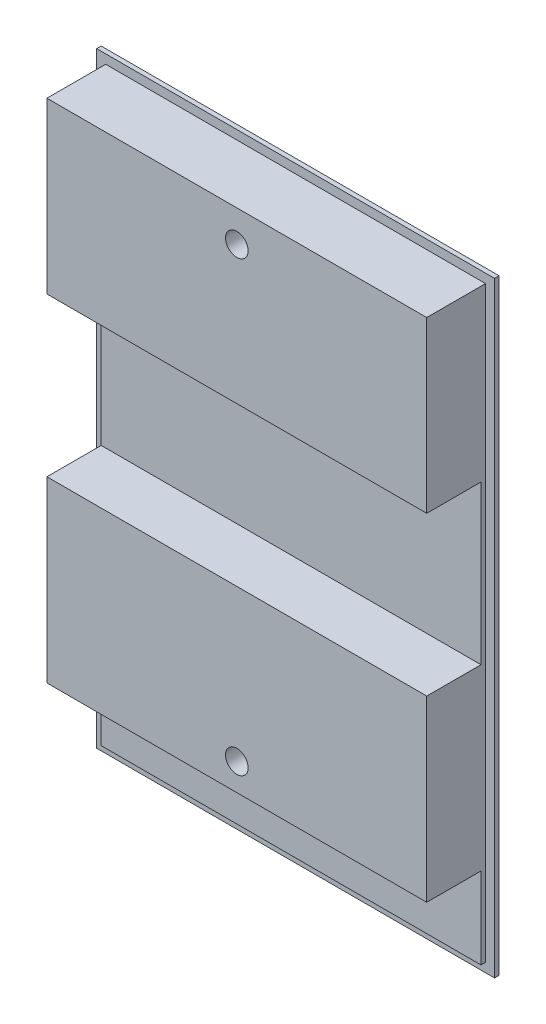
from build123d import *

# Parameters (mm, degrees)
SKIZZE1_W                       = 84
SKIZZE1_H                       = 130
AUFSATZ_LINEAR_AUSTRAGEN1_DEPTH = 2
SKIZZE2_W                       = 84
SKIZZE2_H                       = 37.5
SKIZZE2_R                       = 2.5
SKIZZE2_H_2                     = 39.5
AUFSATZ_LINEAR_AUSTRAGEN2_DEPTH = 12
SKIZZE3_W                       = 88
SKIZZE3_H                       = 134
AUFSATZ_LINEAR_AUSTRAGEN3_DEPTH = 1


with BuildPart() as part:
    # Skizze1 → Aufsatz-Linear austragen1 (new body)
    with BuildSketch(Plane.XY):
        Rectangle(SKIZZE1_W, SKIZZE1_H)
    extrude(amount=AUFSATZ_LINEAR_AUSTRAGEN1_DEPTH)

    # Skizze2 → Aufsatz-Linear austragen2 (add)
    # profile 1 of 2: a face of its own
    with BuildSketch(Plane.XY.offset(2)):
        with Locations((0, 46.25)):
            Rectangle(SKIZZE2_W, SKIZZE2_H)
        with Locations((0, 58)):
            Circle(SKIZZE2_R, mode=Mode.SUBTRACT)
    # profile 2 of 2: a face of its own
    with BuildSketch(Plane.XY.offset(2)):
        with Locations((0, -27.25)):
            Rectangle(SKIZZE2_W, SKIZZE2_H_2)
        with Locations((0, -41)):
            Circle(SKIZZE2_R, mode=Mode.SUBTRACT)
    extrude(amount=AUFSATZ_LINEAR_AUSTRAGEN2_DEPTH)

    # Skizze3 → Aufsatz-Linear austragen3 (add)
    with BuildSketch(Plane(origin=(0, 0, 0), x_dir=(-1, 0, 0), z_dir=(0, 0, -1))):
        Rectangle(SKIZZE3_W, SKIZZE3_H)
    extrude(amount=-AUFSATZ_LINEAR_AUSTRAGEN3_DEPTH)


solid = part.part
